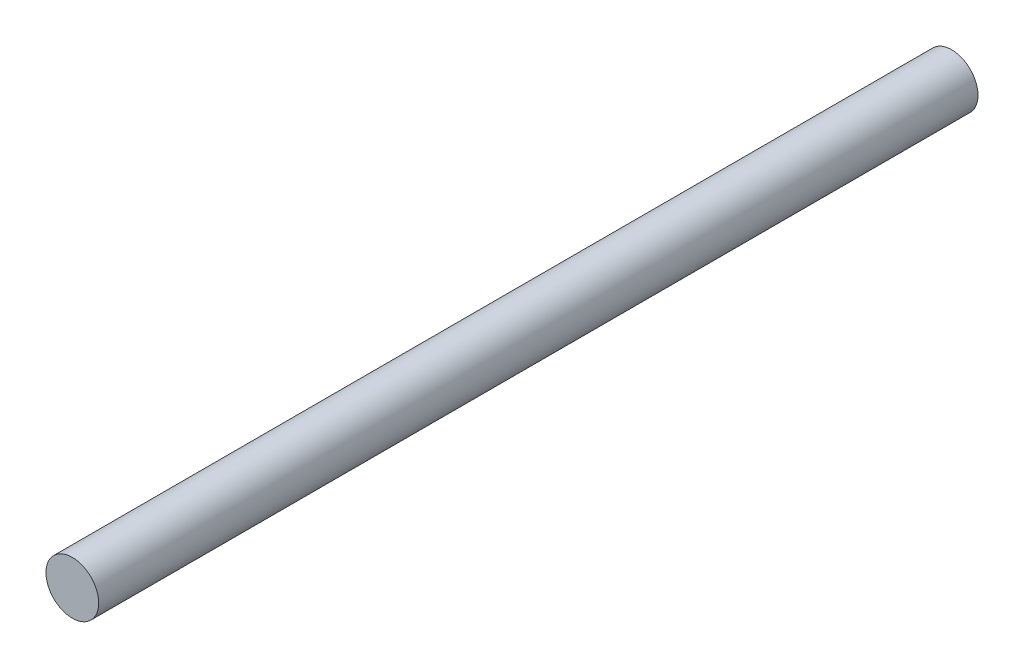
ISO-10303-21;
HEADER;
FILE_DESCRIPTION(('STEP AP214'),'2;1');
FILE_NAME('part.step','',(''),(''),'','','');
FILE_SCHEMA(('AUTOMOTIVE_DESIGN { 1 0 10303 214 1 1 1 1 }'));
ENDSEC;
DATA;
#1=APPLICATION_CONTEXT('core data for automotive mechanical design processes');
#2=APPLICATION_PROTOCOL_DEFINITION('international standard','automotive_design',2000,#1);
#3=PRODUCT_CONTEXT('',#1,'mechanical');
#4=PRODUCT('Part','Part','',(#3));
#5=PRODUCT_RELATED_PRODUCT_CATEGORY('part','',(#4));
#6=PRODUCT_DEFINITION_FORMATION('','',#4);
#7=PRODUCT_DEFINITION_CONTEXT('part definition',#1,'design');
#8=PRODUCT_DEFINITION('design','',#6,#7);
#9=PRODUCT_DEFINITION_SHAPE('','',#8);
#10=(LENGTH_UNIT() NAMED_UNIT(*) SI_UNIT(.MILLI.,.METRE.));
#11=(NAMED_UNIT(*) PLANE_ANGLE_UNIT() SI_UNIT($,.RADIAN.));
#12=(NAMED_UNIT(*) SI_UNIT($,.STERADIAN.) SOLID_ANGLE_UNIT());
#13=UNCERTAINTY_MEASURE_WITH_UNIT(LENGTH_MEASURE(1.E-05),#10,'distance_accuracy_value','');
#14=(GEOMETRIC_REPRESENTATION_CONTEXT(3) GLOBAL_UNCERTAINTY_ASSIGNED_CONTEXT((#13)) GLOBAL_UNIT_ASSIGNED_CONTEXT((#10,
#11,#12)) REPRESENTATION_CONTEXT('',''));
#15=CARTESIAN_POINT('',(0.,0.,0.));
#16=DIRECTION('',(0.,0.,1.));
#17=DIRECTION('',(1.,0.,0.));
#18=AXIS2_PLACEMENT_3D('',#15,#16,#17);
#19=CARTESIAN_POINT('',(0.,0.,-500.));
#20=DIRECTION('',(0.,0.,1.));
#21=DIRECTION('',(1.,0.,0.));
#22=AXIS2_PLACEMENT_3D('',#19,#20,#21);
#23=CYLINDRICAL_SURFACE('',#22,30.);
#24=CARTESIAN_POINT('',(0.,0.,-500.));
#25=DIRECTION('',(0.,0.,1.));
#26=DIRECTION('',(1.,0.,0.));
#27=AXIS2_PLACEMENT_3D('',#24,#25,#26);
#28=CIRCLE('',#27,30.);
#29=CARTESIAN_POINT('',(30.,0.,-500.));
#30=VERTEX_POINT('',#29);
#31=EDGE_CURVE('E42',#30,#30,#28,.T.);
#32=ORIENTED_EDGE('',*,*,#31,.T.);
#33=EDGE_LOOP('',(#32));
#34=FACE_BOUND('',#33,.T.);
#35=CARTESIAN_POINT('',(0.,0.,500.));
#36=DIRECTION('',(0.,0.,1.));
#37=DIRECTION('',(1.,0.,0.));
#38=AXIS2_PLACEMENT_3D('',#35,#36,#37);
#39=CIRCLE('',#38,30.);
#40=CARTESIAN_POINT('',(30.,0.,500.));
#41=VERTEX_POINT('',#40);
#42=EDGE_CURVE('E46',#41,#41,#39,.T.);
#43=ORIENTED_EDGE('',*,*,#42,.F.);
#44=EDGE_LOOP('',(#43));
#45=FACE_BOUND('',#44,.T.);
#46=ADVANCED_FACE('F36',(#34,#45),#23,.T.);
#47=CARTESIAN_POINT('',(0.,0.,-500.));
#48=DIRECTION('',(0.,0.,1.));
#49=DIRECTION('',(1.,0.,0.));
#50=AXIS2_PLACEMENT_3D('',#47,#48,#49);
#51=PLANE('',#50);
#52=ORIENTED_EDGE('',*,*,#31,.F.);
#53=EDGE_LOOP('',(#52));
#54=FACE_BOUND('',#53,.T.);
#55=ADVANCED_FACE('F169',(#54),#51,.F.);
#56=CARTESIAN_POINT('',(0.,0.,500.));
#57=DIRECTION('',(0.,0.,1.));
#58=DIRECTION('',(1.,0.,0.));
#59=AXIS2_PLACEMENT_3D('',#56,#57,#58);
#60=PLANE('',#59);
#61=ORIENTED_EDGE('',*,*,#42,.T.);
#62=EDGE_LOOP('',(#61));
#63=FACE_BOUND('',#62,.T.);
#64=ADVANCED_FACE('F163',(#63),#60,.T.);
#65=CLOSED_SHELL('',(#46,#55,#64));
#66=CARTESIAN_POINT('',(0.,0.,-495.));
#67=DIRECTION('',(0.,0.,1.));
#68=DIRECTION('',(1.,0.,0.));
#69=AXIS2_PLACEMENT_3D('',#66,#67,#68);
#70=CYLINDRICAL_SURFACE('',#69,25.);
#71=CARTESIAN_POINT('',(0.,0.,-495.));
#72=DIRECTION('',(0.,0.,1.));
#73=DIRECTION('',(1.,0.,0.));
#74=AXIS2_PLACEMENT_3D('',#71,#72,#73);
#75=CIRCLE('',#74,25.);
#76=CARTESIAN_POINT('',(25.,0.,-495.));
#77=VERTEX_POINT('',#76);
#78=EDGE_CURVE('E50',#77,#77,#75,.T.);
#79=ORIENTED_EDGE('',*,*,#78,.F.);
#80=EDGE_LOOP('',(#79));
#81=FACE_BOUND('',#80,.T.);
#82=CARTESIAN_POINT('',(0.,0.,-0.5));
#83=DIRECTION('',(0.,0.,1.));
#84=DIRECTION('',(1.,0.,0.));
#85=AXIS2_PLACEMENT_3D('',#82,#83,#84);
#86=CIRCLE('',#85,25.);
#87=CARTESIAN_POINT('',(25.,0.,-0.5));
#88=VERTEX_POINT('',#87);
#89=EDGE_CURVE('E11',#88,#88,#86,.F.);
#90=ORIENTED_EDGE('',*,*,#89,.F.);
#91=EDGE_LOOP('',(#90));
#92=FACE_BOUND('',#91,.T.);
#93=ADVANCED_FACE('F90',(#81,#92),#70,.F.);
#94=CARTESIAN_POINT('',(0.,0.,-495.));
#95=DIRECTION('',(0.,0.,1.));
#96=DIRECTION('',(1.,0.,0.));
#97=AXIS2_PLACEMENT_3D('',#94,#95,#96);
#98=PLANE('',#97);
#99=ORIENTED_EDGE('',*,*,#78,.T.);
#100=EDGE_LOOP('',(#99));
#101=FACE_BOUND('',#100,.T.);
#102=ADVANCED_FACE('F88',(#101),#98,.T.);
#103=CARTESIAN_POINT('',(0.,0.,-0.5));
#104=DIRECTION('',(0.,0.,1.));
#105=DIRECTION('',(1.,0.,0.));
#106=AXIS2_PLACEMENT_3D('',#103,#104,#105);
#107=PLANE('',#106);
#108=CARTESIAN_POINT('',(0.,0.,-0.5));
#109=DIRECTION('',(0.,0.,1.));
#110=DIRECTION('',(1.,0.,0.));
#111=AXIS2_PLACEMENT_3D('',#108,#109,#110);
#112=CIRCLE('',#111,10.);
#113=CARTESIAN_POINT('',(10.,0.,-0.5));
#114=VERTEX_POINT('',#113);
#115=EDGE_CURVE('E64',#114,#114,#112,.T.);
#116=ORIENTED_EDGE('',*,*,#115,.T.);
#117=EDGE_LOOP('',(#116));
#118=FACE_BOUND('',#117,.T.);
#119=ORIENTED_EDGE('',*,*,#89,.T.);
#120=EDGE_LOOP('',(#119));
#121=FACE_BOUND('',#120,.T.);
#122=ADVANCED_FACE('F71',(#118,#121),#107,.F.);
#123=CARTESIAN_POINT('',(0.,0.,0.));
#124=DIRECTION('',(0.,0.,1.));
#125=DIRECTION('',(1.,0.,0.));
#126=AXIS2_PLACEMENT_3D('',#123,#124,#125);
#127=CONICAL_SURFACE('',#126,10.,0.78539816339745);
#128=CARTESIAN_POINT('',(0.,0.,0.5));
#129=DIRECTION('',(0.,0.,1.));
#130=DIRECTION('',(1.,0.,0.));
#131=AXIS2_PLACEMENT_3D('',#128,#129,#130);
#132=CIRCLE('',#131,10.5);
#133=CARTESIAN_POINT('',(10.5,0.,0.5));
#134=VERTEX_POINT('',#133);
#135=EDGE_CURVE('E61',#134,#134,#132,.T.);
#136=ORIENTED_EDGE('',*,*,#135,.T.);
#137=EDGE_LOOP('',(#136));
#138=FACE_BOUND('',#137,.T.);
#139=CARTESIAN_POINT('',(0.,0.,0.));
#140=DIRECTION('',(0.,0.,1.));
#141=DIRECTION('',(1.,0.,0.));
#142=AXIS2_PLACEMENT_3D('',#139,#140,#141);
#143=CIRCLE('',#142,10.);
#144=CARTESIAN_POINT('',(10.,0.,0.));
#145=VERTEX_POINT('',#144);
#146=EDGE_CURVE('E65',#145,#145,#143,.T.);
#147=ORIENTED_EDGE('',*,*,#146,.F.);
#148=EDGE_LOOP('',(#147));
#149=FACE_BOUND('',#148,.T.);
#150=ADVANCED_FACE('F77',(#138,#149),#127,.F.);
#151=CARTESIAN_POINT('',(0.,0.,-0.5));
#152=DIRECTION('',(0.,0.,1.));
#153=DIRECTION('',(1.,0.,0.));
#154=AXIS2_PLACEMENT_3D('',#151,#152,#153);
#155=CYLINDRICAL_SURFACE('',#154,10.);
#156=ORIENTED_EDGE('',*,*,#115,.F.);
#157=EDGE_LOOP('',(#156));
#158=FACE_BOUND('',#157,.T.);
#159=ORIENTED_EDGE('',*,*,#146,.T.);
#160=EDGE_LOOP('',(#159));
#161=FACE_BOUND('',#160,.T.);
#162=ADVANCED_FACE('F73',(#158,#161),#155,.F.);
#163=CARTESIAN_POINT('',(0.,0.,0.5));
#164=DIRECTION('',(0.,0.,1.));
#165=DIRECTION('',(1.,0.,0.));
#166=AXIS2_PLACEMENT_3D('',#163,#164,#165);
#167=PLANE('',#166);
#168=CARTESIAN_POINT('',(0.,0.,0.5));
#169=DIRECTION('',(0.,0.,1.));
#170=DIRECTION('',(1.,0.,0.));
#171=AXIS2_PLACEMENT_3D('',#168,#169,#170);
#172=CIRCLE('',#171,25.);
#173=CARTESIAN_POINT('',(25.,0.,0.5));
#174=VERTEX_POINT('',#173);
#175=EDGE_CURVE('E58',#174,#174,#172,.T.);
#176=ORIENTED_EDGE('',*,*,#175,.T.);
#177=EDGE_LOOP('',(#176));
#178=FACE_BOUND('',#177,.T.);
#179=ORIENTED_EDGE('',*,*,#135,.F.);
#180=EDGE_LOOP('',(#179));
#181=FACE_BOUND('',#180,.T.);
#182=ADVANCED_FACE('F76',(#178,#181),#167,.T.);
#183=CARTESIAN_POINT('',(0.,0.,495.));
#184=DIRECTION('',(0.,0.,1.));
#185=DIRECTION('',(1.,0.,0.));
#186=AXIS2_PLACEMENT_3D('',#183,#184,#185);
#187=PLANE('',#186);
#188=CARTESIAN_POINT('',(0.,0.,495.));
#189=DIRECTION('',(0.,0.,1.));
#190=DIRECTION('',(1.,0.,0.));
#191=AXIS2_PLACEMENT_3D('',#188,#189,#190);
#192=CIRCLE('',#191,25.);
#193=CARTESIAN_POINT('',(25.,0.,495.));
#194=VERTEX_POINT('',#193);
#195=EDGE_CURVE('E55',#194,#194,#192,.T.);
#196=ORIENTED_EDGE('',*,*,#195,.F.);
#197=EDGE_LOOP('',(#196));
#198=FACE_BOUND('',#197,.T.);
#199=ADVANCED_FACE('F107',(#198),#187,.F.);
#200=ORIENTED_EDGE('',*,*,#175,.F.);
#201=EDGE_LOOP('',(#200));
#202=FACE_BOUND('',#201,.T.);
#203=ORIENTED_EDGE('',*,*,#195,.T.);
#204=EDGE_LOOP('',(#203));
#205=FACE_BOUND('',#204,.T.);
#206=ADVANCED_FACE('F96',(#202,#205),#70,.F.);
#207=CLOSED_SHELL('',(#93,#102,#122,#150,#162,#182,#199,#206));
#208=ORIENTED_CLOSED_SHELL('',*,#207,.T.);
#209=BREP_WITH_VOIDS('B2',#65,(#208));
#210=ADVANCED_BREP_SHAPE_REPRESENTATION('',(#18,#209),#14);
#211=SHAPE_DEFINITION_REPRESENTATION(#9,#210);
ENDSEC;
END-ISO-10303-21;
